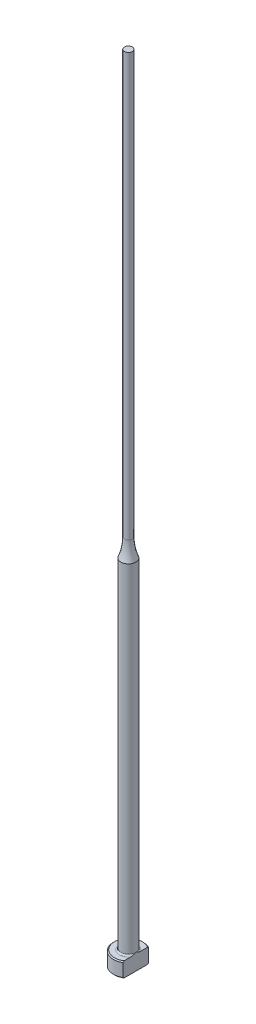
from build123d import *
from build123d.topology import SkipClean

# Parameters (mm, degrees)
CHAMFER1_SIZE = 0.2
FILLET1_R     = 0.3
KEY_DEPTH     = 161.056240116


with BuildPart() as part:
    # Sketch1 → Revolve1 (revolve)
    with BuildSketch(Plane.XY, mode=Mode.PRIVATE) as revolve1_sk:
        with BuildLine():
            Line((0, 0), (-3, 0))
            Line((-3, 0), (-3, 3))
            Line((-3, 3), (-1.5, 3))
            Line((-1.5, 3), (-1.5, 71.32440481))
            ThreePointArc((-1.5, 71.32440481), (-0.976558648, 73.129171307), (-0.8, 75))
            Line((-0.8, 75), (-0.8, 160))
            Line((-0.8, 160), (0, 160))
            Line((0, 160), (0, 0))
        make_face()
    revolve(revolve1_sk.sketch.rotate(Axis((0, 259.958771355, 0), (0, -1, 0)), 270), axis=Axis((0, 259.958771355, 0), (0, -1, 0)))

    # Chamfer1
    chamfer1_edges = [part.edges().sort_by_distance(p)[0] for p in [
        (0, 0, -3),
        (0, 3, -3),
    ]]
    chamfer(chamfer1_edges, length=CHAMFER1_SIZE)

    # Fillet1
    fillet1_edges = [part.edges().sort_by_distance(p)[0] for p in [
        (0, 3, -1.5),
    ]]
    fillet(fillet1_edges, radius=FILLET1_R)

    # Sketch2 → KEY (cut, through all)
    with SkipClean():  # the faces are left unmerged after this step: merging them gives an invalid solid
        with BuildSketch(Plane(origin=(0, 0, 0), x_dir=(1, 0, 0), z_dir=(0, 1, 0))):
            with BuildLine():
                Line((1.5, 2.598076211), (1.5, -2.598076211))
                ThreePointArc((1.5, -2.598076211), (3, 0), (1.5, 2.598076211))
            make_face()
        extrude(amount=KEY_DEPTH, mode=Mode.SUBTRACT)


solid = part.part
